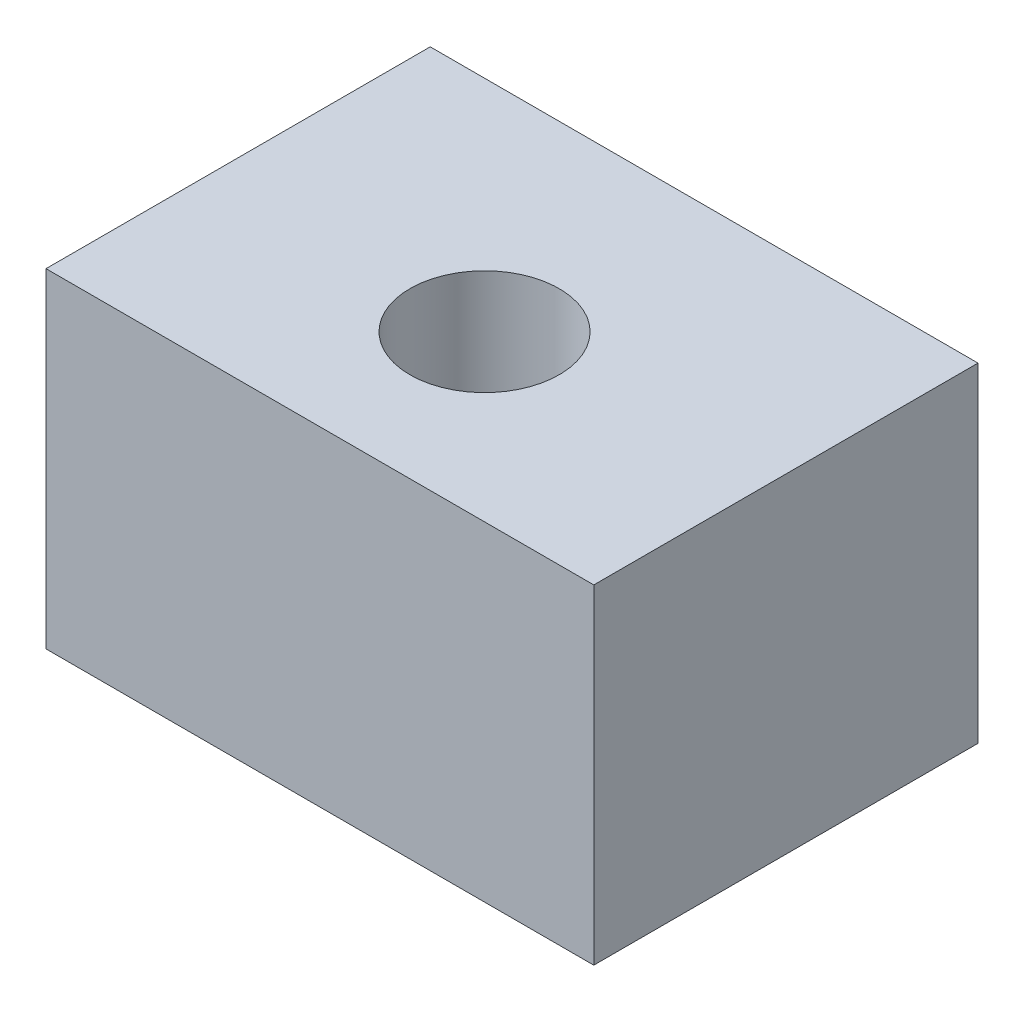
from build123d import *

# Parameters (mm, degrees)
SKETCH1_W             = 12.6746
SKETCH1_H             = 7.62
BOSS_EXTRUDE1_DEPTH   = 8.89
F_4_CLEARANCE_HOLE1_D = 3.4544


with BuildPart() as part:
    # Sketch1 → Boss-Extrude1 (new body)
    with BuildSketch(Plane.XY):
        with Locations((6.3373, 3.81)):
            Rectangle(SKETCH1_W, SKETCH1_H)
    extrude(amount=BOSS_EXTRUDE1_DEPTH)

    # 4 Clearance Hole1 (through all)
    with Locations(Plane(origin=(0, 7.62, 0), x_dir=(1, 0, 0), z_dir=(0, 1, 0))):
        with Locations((6.3373, -5.08)):
            Hole(F_4_CLEARANCE_HOLE1_D / 2)


solid = part.part
